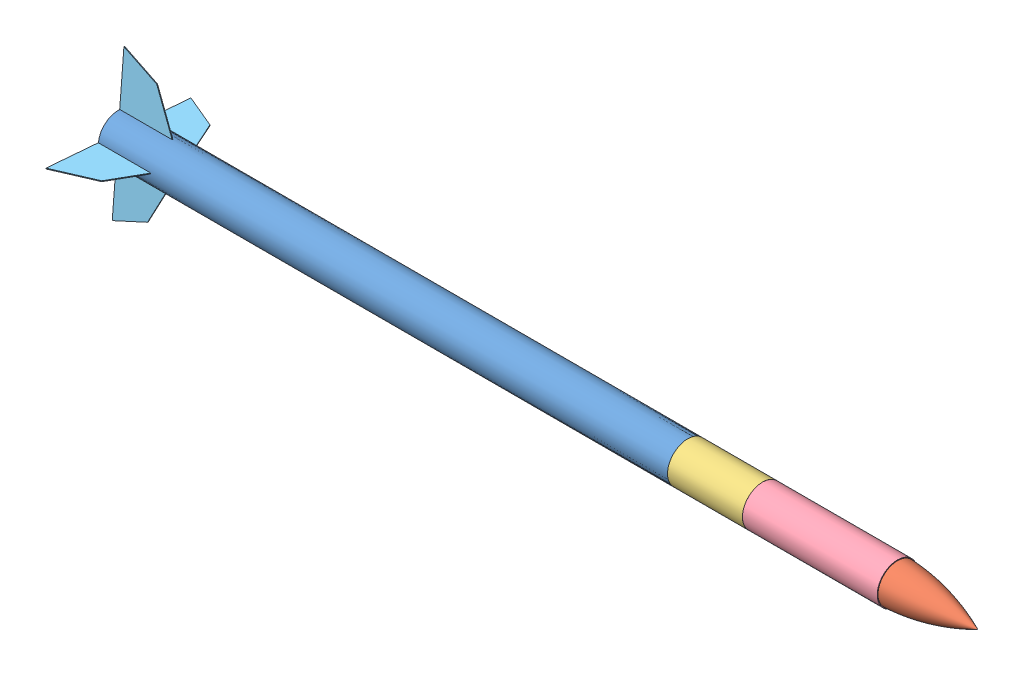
SolidWorks assembly Mont1.sldasm, configuration Valor predeterminado (file format 14000). Lengths in mm.
Overall size (1147.55 193.47 193.47).
8 component instances, 5 part files, 19 mates.
Components (placement in the parent):
- corposupmain54-1: corposupmain54.SLDPRT [Valor predeterminado] at (-144.3843 59.0032 760) x (0 1 0) z (1 0 0) size (54 54 760)
- conesup54-1: conesup54.SLDPRT [Valor predeterminado] at (623.1576 59.0032 760) x (-1 0 0) z (0 -0.938708 0.344714) size (107.54 52 52)
- conector54-1: conector54.SLDPRT [Valor predeterminado] at (285.6157 59.0032 760) x (0 1 0) z (1 0 0) size (54 54 150)
- contcone54-1: contcone54.SLDPRT [Valor predeterminado] at (425.6157 59.0032 760) x (0 0.938708 -0.344714) z (-1 0 0) size (54 54 180)
- stablesup54-1: stablesup54.SLDPRT [Valor predeterminado] at (-489.3843 85.9562 758.3316) x (-1 0 0) z (0 -0.080252 -0.996775) size (70.01 70.01 1.01)
- stablesup54-3: stablesup54.SLDPRT [Valor predeterminado] at (-524.3843 64.4772 821.7599) x (0 -0.080252 -0.996775) z (0 -0.996775 0.080252) size (70.01 70.01 1.01)
- stablesup54-4: stablesup54.SLDPRT [Valor predeterminado] at (-489.3843 57.3348 733.047) x (-1 0 0) z (0 -0.996775 0.080252) size (70.01 70.01 1.01)
- stablesup54-5: stablesup54.SLDPRT [Valor predeterminado] at (-489.3843 32.0502 761.6684) x (-1 0 0) z (0 0.080252 0.996775) size (70.01 70.01 1.01)
Mates (geometry in assembly coordinates):
- Concêntrico1: concentric aligned: circle of corposupmain54-1; circle of conector54-1
- Coincidente2: coincident anti-aligned: plane of corposupmain54-1 through (235.6157 59.0032 760) normal (1 0 0); plane of conector54-1 through (235.6157 59.0032 760) normal (-1 0 0)
- Coincidente3: coincident anti-aligned: circle of conector54-1; circle of contcone54-1
- Concêntrico2: concentric aligned: circle of conesup54-1; circle of contcone54-1
- Bloquear1: lock: unknown of conesup54-1; unknown of contcone54-1
- Bloquear2: lock: unknown of corposupmain54-1; unknown of conector54-1
- Tangente2: tangent anti-aligned: cylinder of corposupmain54-1 through (235.6157 59.0032 760) axis (-1 0 0) radius 27; plane of stablesup54-1 through (-524.3843 85.876 757.3348) normal (0 -0.996775 0.080252)
- Coincidente5: coincident aligned: plane of corposupmain54-1 through (-524.3843 59.0032 760) normal (-1 0 0); plane of stablesup54-1 through (-524.3843 85.876 757.3348) normal (-1 0 0)
- Tangente3: tangent: cylinder of corposupmain54-1 through (235.6157 59.0032 760) axis (-1 0 0) radius 27; plane of stablesup54-3 through (-524.3843 60.6716 786.953) normal (0 -0.080252 -0.996775)
- Coincidente7: coincident: plane of corposupmain54-1 through (-524.3843 59.0032 760) normal (-1 0 0); plane of stablesup54-3 through (-524.3843 60.6716 786.953) normal (-1 0 0)
- Tangente4: tangent anti-aligned: cylinder of corposupmain54-1 through (235.6157 59.0032 760) axis (-1 0 0) radius 27; plane of stablesup54-4 through (-524.3843 56.338 733.1272) normal (0 0.080252 0.996775)
- Coincidente9: coincident aligned: plane of corposupmain54-1 through (-524.3843 59.0032 760) normal (-1 0 0); plane of stablesup54-4 through (-524.3843 56.338 733.1272) normal (-1 0 0)
- Tangente5: tangent anti-aligned: cylinder of corposupmain54-1 through (235.6157 59.0032 760) axis (-1 0 0) radius 27; plane of stablesup54-5 through (-524.3843 32.1304 762.6652) normal (0 0.996775 -0.080252)
- Coincidente11: coincident aligned: plane of corposupmain54-1 through (-524.3843 59.0032 760) normal (-1 0 0); plane of stablesup54-5 through (-524.3843 32.1304 762.6652) normal (-1 0 0)
- Bloquear3: lock: unknown of corposupmain54-1; unknown of stablesup54-5
- Bloquear4: lock: unknown of corposupmain54-1; unknown of stablesup54-4
- Bloquear5: lock: unknown of corposupmain54-1; unknown of stablesup54-1
- Bloquear6: lock: unknown of corposupmain54-1; unknown of stablesup54-3
- Bloquear7: lock: unknown of conector54-1; unknown of contcone54-1
